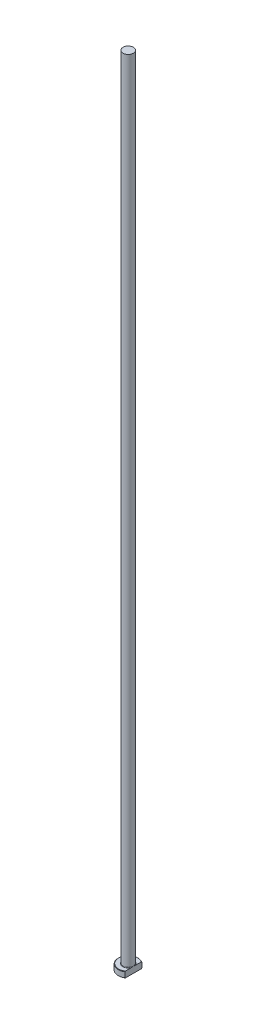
ISO-10303-21;
HEADER;
FILE_DESCRIPTION(('STEP AP214'),'2;1');
FILE_NAME('part.step','',(''),(''),'','','');
FILE_SCHEMA(('AUTOMOTIVE_DESIGN { 1 0 10303 214 1 1 1 1 }'));
ENDSEC;
DATA;
#1=APPLICATION_CONTEXT('core data for automotive mechanical design processes');
#2=APPLICATION_PROTOCOL_DEFINITION('international standard','automotive_design',2000,#1);
#3=PRODUCT_CONTEXT('',#1,'mechanical');
#4=PRODUCT('Part','Part','',(#3));
#5=PRODUCT_RELATED_PRODUCT_CATEGORY('part','',(#4));
#6=PRODUCT_DEFINITION_FORMATION('','',#4);
#7=PRODUCT_DEFINITION_CONTEXT('part definition',#1,'design');
#8=PRODUCT_DEFINITION('design','',#6,#7);
#9=PRODUCT_DEFINITION_SHAPE('','',#8);
#10=(LENGTH_UNIT() NAMED_UNIT(*) SI_UNIT(.MILLI.,.METRE.));
#11=(NAMED_UNIT(*) PLANE_ANGLE_UNIT() SI_UNIT($,.RADIAN.));
#12=(NAMED_UNIT(*) SI_UNIT($,.STERADIAN.) SOLID_ANGLE_UNIT());
#13=UNCERTAINTY_MEASURE_WITH_UNIT(LENGTH_MEASURE(1.E-05),#10,'distance_accuracy_value','');
#14=(GEOMETRIC_REPRESENTATION_CONTEXT(3) GLOBAL_UNCERTAINTY_ASSIGNED_CONTEXT((#13)) GLOBAL_UNIT_ASSIGNED_CONTEXT((#10,
#11,#12)) REPRESENTATION_CONTEXT('',''));
#15=CARTESIAN_POINT('',(0.,0.,0.));
#16=DIRECTION('',(0.,0.,1.));
#17=DIRECTION('',(1.,0.,0.));
#18=AXIS2_PLACEMENT_3D('',#15,#16,#17);
#19=CARTESIAN_POINT('',(0.,0.,0.));
#20=DIRECTION('',(0.,-1.,0.));
#21=DIRECTION('',(0.,0.,-1.));
#22=AXIS2_PLACEMENT_3D('',#19,#20,#21);
#23=PLANE('',#22);
#24=CARTESIAN_POINT('',(0.,0.,0.));
#25=DIRECTION('',(0.,-1.,0.));
#26=DIRECTION('',(0.,0.,-1.));
#27=AXIS2_PLACEMENT_3D('',#24,#25,#26);
#28=CIRCLE('',#27,4.79999999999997);
#29=CARTESIAN_POINT('',(2.59999999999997,0.,4.03484820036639));
#30=VERTEX_POINT('',#29);
#31=CARTESIAN_POINT('',(2.59999999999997,0.,-4.03484820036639));
#32=VERTEX_POINT('',#31);
#33=EDGE_CURVE('E98',#30,#32,#28,.T.);
#34=ORIENTED_EDGE('',*,*,#33,.T.);
#35=DIRECTION('',(0.,0.,1.));
#36=VECTOR('',#35,1.);
#37=CARTESIAN_POINT('',(2.59999999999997,0.,-4.27083130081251));
#38=LINE('',#37,#36);
#39=EDGE_CURVE('E83',#32,#30,#38,.T.);
#40=ORIENTED_EDGE('',*,*,#39,.T.);
#41=EDGE_LOOP('',(#34,#40));
#42=FACE_BOUND('',#41,.T.);
#43=ADVANCED_FACE('F32',(#42),#23,.T.);
#44=CARTESIAN_POINT('',(0.,259.958771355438,0.));
#45=DIRECTION('',(0.,1.,0.));
#46=DIRECTION('',(0.,0.,1.));
#47=AXIS2_PLACEMENT_3D('',#44,#45,#46);
#48=CYLINDRICAL_SURFACE('',#47,4.99999999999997);
#49=CARTESIAN_POINT('',(0.,2.80000000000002,0.));
#50=DIRECTION('',(0.,1.,0.));
#51=DIRECTION('',(0.,0.,1.));
#52=AXIS2_PLACEMENT_3D('',#49,#50,#51);
#53=CIRCLE('',#52,4.99999999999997);
#54=CARTESIAN_POINT('',(2.59999999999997,2.80000000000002,4.27083130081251));
#55=VERTEX_POINT('',#54);
#56=CARTESIAN_POINT('',(2.59999999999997,2.80000000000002,-4.27083130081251));
#57=VERTEX_POINT('',#56);
#58=EDGE_CURVE('E104',#55,#57,#53,.F.);
#59=ORIENTED_EDGE('',*,*,#58,.T.);
#60=DIRECTION('',(0.,-1.,0.));
#61=VECTOR('',#60,1.);
#62=CARTESIAN_POINT('',(2.59999999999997,400.,-4.27083130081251));
#63=LINE('',#62,#61);
#64=CARTESIAN_POINT('',(2.59999999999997,0.199999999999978,-4.27083130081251));
#65=VERTEX_POINT('',#64);
#66=EDGE_CURVE('E183',#57,#65,#63,.T.);
#67=ORIENTED_EDGE('',*,*,#66,.T.);
#68=CARTESIAN_POINT('',(0.,0.199999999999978,0.));
#69=DIRECTION('',(0.,-1.,0.));
#70=DIRECTION('',(0.,0.,-1.));
#71=AXIS2_PLACEMENT_3D('',#68,#69,#70);
#72=CIRCLE('',#71,4.99999999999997);
#73=CARTESIAN_POINT('',(2.59999999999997,0.199999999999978,4.27083130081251));
#74=VERTEX_POINT('',#73);
#75=EDGE_CURVE('E100',#65,#74,#72,.F.);
#76=ORIENTED_EDGE('',*,*,#75,.T.);
#77=DIRECTION('',(0.,-1.,0.));
#78=VECTOR('',#77,1.);
#79=CARTESIAN_POINT('',(2.59999999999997,400.,4.27083130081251));
#80=LINE('',#79,#78);
#81=EDGE_CURVE('E93',#55,#74,#80,.T.);
#82=ORIENTED_EDGE('',*,*,#81,.F.);
#83=EDGE_LOOP('',(#59,#67,#76,#82));
#84=FACE_BOUND('',#83,.T.);
#85=ADVANCED_FACE('F158',(#84),#48,.T.);
#86=CARTESIAN_POINT('',(-4.99999999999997,3.,0.));
#87=DIRECTION('',(0.,1.,0.));
#88=DIRECTION('',(0.,0.,1.));
#89=AXIS2_PLACEMENT_3D('',#86,#87,#88);
#90=PLANE('',#89);
#91=CARTESIAN_POINT('',(0.,3.,0.));
#92=DIRECTION('',(0.,1.,0.));
#93=DIRECTION('',(0.,0.,1.));
#94=AXIS2_PLACEMENT_3D('',#91,#92,#93);
#95=CIRCLE('',#94,4.79999999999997);
#96=CARTESIAN_POINT('',(2.59999999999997,3.,-4.03484820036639));
#97=VERTEX_POINT('',#96);
#98=CARTESIAN_POINT('',(2.59999999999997,3.,4.03484820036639));
#99=VERTEX_POINT('',#98);
#100=EDGE_CURVE('E178',#97,#99,#95,.T.);
#101=ORIENTED_EDGE('',*,*,#100,.T.);
#102=DIRECTION('',(0.,0.,-1.));
#103=VECTOR('',#102,1.);
#104=CARTESIAN_POINT('',(2.59999999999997,3.,0.));
#105=LINE('',#104,#103);
#106=CARTESIAN_POINT('',(2.59999999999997,2.99999999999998,1.03923048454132));
#107=VERTEX_POINT('',#106);
#108=EDGE_CURVE('E57',#99,#107,#105,.T.);
#109=ORIENTED_EDGE('',*,*,#108,.T.);
#110=CARTESIAN_POINT('',(0.,3.,0.));
#111=DIRECTION('',(0.,1.,0.));
#112=DIRECTION('',(0.,0.,1.));
#113=AXIS2_PLACEMENT_3D('',#110,#111,#112);
#114=CIRCLE('',#113,2.79999999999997);
#115=CARTESIAN_POINT('',(2.59999999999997,2.99999999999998,-1.03923048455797));
#116=VERTEX_POINT('',#115);
#117=EDGE_CURVE('E107',#107,#116,#114,.F.);
#118=ORIENTED_EDGE('',*,*,#117,.T.);
#119=EDGE_CURVE('E136',#116,#97,#105,.T.);
#120=ORIENTED_EDGE('',*,*,#119,.T.);
#121=EDGE_LOOP('',(#101,#109,#118,#120));
#122=FACE_BOUND('',#121,.T.);
#123=ADVANCED_FACE('F147',(#122),#90,.T.);
#124=CARTESIAN_POINT('',(0.,3.,0.));
#125=DIRECTION('',(0.,-1.,0.));
#126=DIRECTION('',(0.,0.,-1.));
#127=AXIS2_PLACEMENT_3D('',#124,#125,#126);
#128=CONICAL_SURFACE('',#127,4.79999999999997,0.785398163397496);
#129=ORIENTED_EDGE('',*,*,#58,.F.);
#130=CARTESIAN_POINT('',(2.59999999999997,-1.95047472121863,9.397433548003));
#131=CARTESIAN_POINT('',(2.59999999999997,-1.7601520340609,9.19995130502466));
#132=CARTESIAN_POINT('',(2.59999999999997,-1.57004107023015,9.0022644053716));
#133=CARTESIAN_POINT('',(2.59999999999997,-1.1903545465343,8.60637345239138));
#134=CARTESIAN_POINT('',(2.59999999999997,-1.00077899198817,8.40816939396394));
#135=CARTESIAN_POINT('',(2.59999999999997,-0.622208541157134,8.01106626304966));
#136=CARTESIAN_POINT('',(2.59999999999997,-0.433213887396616,7.81216695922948));
#137=CARTESIAN_POINT('',(2.59999999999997,-0.0560371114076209,7.41360059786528));
#138=CARTESIAN_POINT('',(2.59999999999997,0.132145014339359,7.21393354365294));
#139=CARTESIAN_POINT('',(2.59999999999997,0.504316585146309,6.81701377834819));
#140=CARTESIAN_POINT('',(2.59999999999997,0.688323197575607,6.61977717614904));
#141=CARTESIAN_POINT('',(2.59999999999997,1.05506202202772,6.22412305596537));
#142=CARTESIAN_POINT('',(2.59999999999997,1.23779424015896,6.02570554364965));
#143=CARTESIAN_POINT('',(2.59999999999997,1.60155525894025,5.62737135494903));
#144=CARTESIAN_POINT('',(2.59999999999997,1.7825843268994,5.42745492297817));
#145=CARTESIAN_POINT('',(2.59999999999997,2.14238277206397,5.02560172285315));
#146=CARTESIAN_POINT('',(2.59999999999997,2.32115220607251,4.82366500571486));
#147=CARTESIAN_POINT('',(2.59999999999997,2.62527031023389,4.4746966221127));
#148=CARTESIAN_POINT('',(2.59999999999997,2.75138938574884,4.32833728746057));
#149=CARTESIAN_POINT('',(2.59999999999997,3.00151582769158,4.03379615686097));
#150=CARTESIAN_POINT('',(2.59999999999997,3.12552298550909,3.88561418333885));
#151=CARTESIAN_POINT('',(2.59999999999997,3.37190002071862,3.58545728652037));
#152=CARTESIAN_POINT('',(2.59999999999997,3.49424212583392,3.43345946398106));
#153=CARTESIAN_POINT('',(2.59999999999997,3.73490070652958,3.12636139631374));
#154=CARTESIAN_POINT('',(2.59999999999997,3.85321820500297,2.97126195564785));
#155=CARTESIAN_POINT('',(2.59999999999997,4.08579009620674,2.65464223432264));
#156=CARTESIAN_POINT('',(2.59999999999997,4.19996477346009,2.49306256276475));
#157=CARTESIAN_POINT('',(2.59999999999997,4.36468341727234,2.24613590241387));
#158=CARTESIAN_POINT('',(2.59999999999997,4.41853818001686,2.16300143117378));
#159=CARTESIAN_POINT('',(2.59999999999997,4.52346182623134,1.99499855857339));
#160=CARTESIAN_POINT('',(2.59999999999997,4.574530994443,1.9101303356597));
#161=CARTESIAN_POINT('',(2.59999999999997,4.67263274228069,1.7393256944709));
#162=CARTESIAN_POINT('',(2.59999999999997,4.71970407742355,1.65341183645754));
#163=CARTESIAN_POINT('',(2.59999999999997,4.80952240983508,1.47936505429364));
#164=CARTESIAN_POINT('',(2.59999999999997,4.8522685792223,1.3912317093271));
#165=CARTESIAN_POINT('',(2.59999999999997,4.97211006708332,1.12354274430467));
#166=CARTESIAN_POINT('',(2.59999999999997,5.04118725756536,0.940070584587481));
#167=CARTESIAN_POINT('',(2.59999999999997,5.11752261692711,0.665284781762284));
#168=CARTESIAN_POINT('',(2.59999999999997,5.1380299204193,0.577624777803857));
#169=CARTESIAN_POINT('',(2.59999999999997,5.17073291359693,0.400736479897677));
#170=CARTESIAN_POINT('',(2.59999999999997,5.18292955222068,0.311508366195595));
#171=CARTESIAN_POINT('',(2.59999999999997,5.19813789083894,0.132628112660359));
#172=CARTESIAN_POINT('',(2.59999999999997,5.20118701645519,0.0429792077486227));
#173=CARTESIAN_POINT('',(2.59999999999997,5.19797827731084,-0.13615453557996));
#174=CARTESIAN_POINT('',(2.59999999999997,5.19171987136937,-0.225639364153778));
#175=CARTESIAN_POINT('',(2.59999999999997,5.17043196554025,-0.402893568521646));
#176=CARTESIAN_POINT('',(2.59999999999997,5.15546490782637,-0.490670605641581));
#177=CARTESIAN_POINT('',(2.59999999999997,5.11776551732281,-0.664523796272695));
#178=CARTESIAN_POINT('',(2.59999999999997,5.09503206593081,-0.750599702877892));
#179=CARTESIAN_POINT('',(2.59999999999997,5.04281440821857,-0.921261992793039));
#180=CARTESIAN_POINT('',(2.59999999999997,5.01328729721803,-1.00583506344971));
#181=CARTESIAN_POINT('',(2.59999999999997,4.94875799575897,-1.17281894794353));
#182=CARTESIAN_POINT('',(2.59999999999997,4.91375683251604,-1.25523016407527));
#183=CARTESIAN_POINT('',(2.59999999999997,4.80599778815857,-1.49096020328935));
#184=CARTESIAN_POINT('',(2.59999999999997,4.72750956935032,-1.64165062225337));
#185=CARTESIAN_POINT('',(2.59999999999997,4.55999715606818,-1.93711610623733));
#186=CARTESIAN_POINT('',(2.59999999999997,4.47096030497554,-2.08188377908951));
#187=CARTESIAN_POINT('',(2.59999999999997,4.28541544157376,-2.36729512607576));
#188=CARTESIAN_POINT('',(2.59999999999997,4.18888021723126,-2.50792095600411));
#189=CARTESIAN_POINT('',(2.59999999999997,3.99085344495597,-2.78550445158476));
#190=CARTESIAN_POINT('',(2.59999999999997,3.88936425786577,-2.92246381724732));
#191=CARTESIAN_POINT('',(2.59999999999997,3.68147097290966,-3.19533708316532));
#192=CARTESIAN_POINT('',(2.59999999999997,3.57502092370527,-3.3312158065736));
#193=CARTESIAN_POINT('',(2.59999999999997,3.35937457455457,-3.60078977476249));
#194=CARTESIAN_POINT('',(2.59999999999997,3.25017800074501,-3.7344847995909));
#195=CARTESIAN_POINT('',(2.59999999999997,3.02996614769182,-3.99983567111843));
#196=CARTESIAN_POINT('',(2.59999999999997,2.9189557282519,-4.1314955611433));
#197=CARTESIAN_POINT('',(2.59999999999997,2.69532568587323,-4.39344289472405));
#198=CARTESIAN_POINT('',(2.59999999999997,2.58270603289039,-4.52373031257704));
#199=CARTESIAN_POINT('',(2.59999999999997,2.28823888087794,-4.86104966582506));
#200=CARTESIAN_POINT('',(2.59999999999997,2.10540318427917,-5.06721827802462));
#201=CARTESIAN_POINT('',(2.59999999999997,1.73743041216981,-5.47749422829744));
#202=CARTESIAN_POINT('',(2.59999999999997,1.55229327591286,-5.68160151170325));
#203=CARTESIAN_POINT('',(2.59999999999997,1.18015264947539,-6.08844300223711));
#204=CARTESIAN_POINT('',(2.59999999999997,0.993147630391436,-6.29117580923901));
#205=CARTESIAN_POINT('',(2.59999999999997,0.617846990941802,-6.69544313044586));
#206=CARTESIAN_POINT('',(2.59999999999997,0.429551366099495,-6.89697764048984));
#207=CARTESIAN_POINT('',(2.59999999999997,0.0594707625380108,-7.29110398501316));
#208=CARTESIAN_POINT('',(2.59999999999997,-0.12227513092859,-7.48373254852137));
#209=CARTESIAN_POINT('',(2.59999999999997,-0.486506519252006,-7.86829020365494));
#210=CARTESIAN_POINT('',(2.59999999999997,-0.668992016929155,-8.06021929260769));
#211=CARTESIAN_POINT('',(2.59999999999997,-1.03436396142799,-8.44329936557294));
#212=CARTESIAN_POINT('',(2.59999999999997,-1.21724976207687,-8.63445096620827));
#213=CARTESIAN_POINT('',(2.59999999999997,-1.58351605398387,-9.01627657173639));
#214=CARTESIAN_POINT('',(2.59999999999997,-1.76689654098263,-9.20695058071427));
#215=CARTESIAN_POINT('',(2.59999999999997,-1.95047472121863,-9.397433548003));
#216=B_SPLINE_CURVE_WITH_KNOTS('',3,(#130,#131,#132,#133,#134,#135,#136,#137,#138,#139,#140,
#141,#142,#143,#144,#145,#146,#147,#148,#149,#150,#151,#152,#153,#154,#155,#156,#157,#158,#159,
#160,#161,#162,#163,#164,#165,#166,#167,#168,#169,#170,#171,#172,#173,#174,#175,#176,#177,#178,
#179,#180,#181,#182,#183,#184,#185,#186,#187,#188,#189,#190,#191,#192,#193,#194,#195,#196,#197,
#198,#199,#200,#201,#202,#203,#204,#205,#206,#207,#208,#209,#210,#211,#212,#213,#214,#215),
.UNSPECIFIED.,.F.,.F.,(4,2,2,2,2,2,2,2,2,2,2,2,2,2,2,2,2,2,2,2,2,2,2,2,2,2,2,2,2,2,2,2,2,2,2,2,
2,2,2,2,2,2,4),(0.,0.822799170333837,1.64560648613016,2.46872021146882,3.29183036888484,
4.10105194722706,4.91026964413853,5.71935814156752,6.5284262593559,7.10801764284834,
7.68766594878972,8.27296873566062,8.85812163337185,9.45143823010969,9.74855643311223,
10.0456442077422,10.3394095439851,10.6332310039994,11.2186835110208,11.4884410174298,
11.7581677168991,12.0267893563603,12.2954266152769,12.5621610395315,12.8289338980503,
13.0974401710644,13.3658961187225,13.8748906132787,14.3845021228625,14.896058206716,
15.4073728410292,15.9251595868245,16.4429981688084,16.9596236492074,17.4762587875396,
18.3029176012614,19.1295982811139,19.9570225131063,20.7844496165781,21.5789508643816,
22.3734551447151,23.1671010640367,23.9607401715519),.UNSPECIFIED.);
#217=EDGE_CURVE('E135',#55,#99,#216,.T.);
#218=ORIENTED_EDGE('',*,*,#217,.T.);
#219=ORIENTED_EDGE('',*,*,#100,.F.);
#220=EDGE_CURVE('E127',#97,#57,#216,.T.);
#221=ORIENTED_EDGE('',*,*,#220,.T.);
#222=EDGE_LOOP('',(#129,#218,#219,#221));
#223=FACE_BOUND('',#222,.T.);
#224=ADVANCED_FACE('F143',(#223),#128,.T.);
#225=CARTESIAN_POINT('',(0.,0.199999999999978,0.));
#226=DIRECTION('',(0.,1.,0.));
#227=DIRECTION('',(0.,0.,1.));
#228=AXIS2_PLACEMENT_3D('',#225,#226,#227);
#229=CONICAL_SURFACE('',#228,4.99999999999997,0.785398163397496);
#230=ORIENTED_EDGE('',*,*,#75,.F.);
#231=CARTESIAN_POINT('',(2.59999999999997,4.95047472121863,-9.397433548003));
#232=CARTESIAN_POINT('',(2.59999999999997,4.7601520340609,-9.19995130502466));
#233=CARTESIAN_POINT('',(2.59999999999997,4.57004107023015,-9.0022644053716));
#234=CARTESIAN_POINT('',(2.59999999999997,4.1903545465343,-8.60637345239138));
#235=CARTESIAN_POINT('',(2.59999999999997,4.00077899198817,-8.40816939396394));
#236=CARTESIAN_POINT('',(2.59999999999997,3.62220854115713,-8.01106626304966));
#237=CARTESIAN_POINT('',(2.59999999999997,3.43321388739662,-7.81216695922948));
#238=CARTESIAN_POINT('',(2.59999999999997,3.05603711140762,-7.41360059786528));
#239=CARTESIAN_POINT('',(2.59999999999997,2.86785498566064,-7.21393354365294));
#240=CARTESIAN_POINT('',(2.59999999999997,2.49568341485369,-6.81701377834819));
#241=CARTESIAN_POINT('',(2.59999999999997,2.3116768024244,-6.61977717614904));
#242=CARTESIAN_POINT('',(2.59999999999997,1.94493797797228,-6.22412305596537));
#243=CARTESIAN_POINT('',(2.59999999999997,1.76220575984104,-6.02570554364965));
#244=CARTESIAN_POINT('',(2.59999999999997,1.39844474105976,-5.62737135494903));
#245=CARTESIAN_POINT('',(2.59999999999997,1.2174156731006,-5.42745492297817));
#246=CARTESIAN_POINT('',(2.59999999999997,0.857617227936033,-5.02560172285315));
#247=CARTESIAN_POINT('',(2.59999999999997,0.67884779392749,-4.82366500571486));
#248=CARTESIAN_POINT('',(2.59999999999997,0.374729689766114,-4.4746966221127));
#249=CARTESIAN_POINT('',(2.59999999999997,0.248610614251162,-4.32833728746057));
#250=CARTESIAN_POINT('',(2.59999999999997,-0.0015158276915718,-4.03379615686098));
#251=CARTESIAN_POINT('',(2.59999999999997,-0.125522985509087,-3.88561418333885));
#252=CARTESIAN_POINT('',(2.59999999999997,-0.371900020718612,-3.58545728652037));
#253=CARTESIAN_POINT('',(2.59999999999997,-0.494242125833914,-3.43345946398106));
#254=CARTESIAN_POINT('',(2.59999999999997,-0.734900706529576,-3.12636139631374));
#255=CARTESIAN_POINT('',(2.59999999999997,-0.853218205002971,-2.97126195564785));
#256=CARTESIAN_POINT('',(2.59999999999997,-1.08579009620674,-2.65464223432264));
#257=CARTESIAN_POINT('',(2.59999999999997,-1.19996477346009,-2.49306256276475));
#258=CARTESIAN_POINT('',(2.59999999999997,-1.36468341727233,-2.24613590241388));
#259=CARTESIAN_POINT('',(2.59999999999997,-1.41853818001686,-2.16300143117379));
#260=CARTESIAN_POINT('',(2.59999999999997,-1.52346182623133,-1.99499855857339));
#261=CARTESIAN_POINT('',(2.59999999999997,-1.574530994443,-1.9101303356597));
#262=CARTESIAN_POINT('',(2.59999999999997,-1.67263274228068,-1.7393256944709));
#263=CARTESIAN_POINT('',(2.59999999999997,-1.71970407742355,-1.65341183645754));
#264=CARTESIAN_POINT('',(2.59999999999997,-1.80952240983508,-1.47936505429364));
#265=CARTESIAN_POINT('',(2.59999999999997,-1.8522685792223,-1.3912317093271));
#266=CARTESIAN_POINT('',(2.59999999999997,-1.97211006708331,-1.12354274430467));
#267=CARTESIAN_POINT('',(2.59999999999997,-2.04118725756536,-0.940070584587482));
#268=CARTESIAN_POINT('',(2.59999999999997,-2.11752261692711,-0.665284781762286));
#269=CARTESIAN_POINT('',(2.59999999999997,-2.1380299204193,-0.577624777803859));
#270=CARTESIAN_POINT('',(2.59999999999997,-2.17073291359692,-0.400736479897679));
#271=CARTESIAN_POINT('',(2.59999999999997,-2.18292955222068,-0.311508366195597));
#272=CARTESIAN_POINT('',(2.59999999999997,-2.19813789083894,-0.132628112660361));
#273=CARTESIAN_POINT('',(2.59999999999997,-2.20118701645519,-0.0429792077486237));
#274=CARTESIAN_POINT('',(2.59999999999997,-2.19797827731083,0.136154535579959));
#275=CARTESIAN_POINT('',(2.59999999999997,-2.19171987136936,0.225639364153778));
#276=CARTESIAN_POINT('',(2.59999999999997,-2.17043196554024,0.402893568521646));
#277=CARTESIAN_POINT('',(2.59999999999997,-2.15546490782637,0.490670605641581));
#278=CARTESIAN_POINT('',(2.59999999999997,-2.11776551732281,0.664523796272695));
#279=CARTESIAN_POINT('',(2.59999999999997,-2.09503206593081,0.750599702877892));
#280=CARTESIAN_POINT('',(2.59999999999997,-2.04281440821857,0.921261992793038));
#281=CARTESIAN_POINT('',(2.59999999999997,-2.01328729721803,1.00583506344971));
#282=CARTESIAN_POINT('',(2.59999999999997,-1.94875799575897,1.17281894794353));
#283=CARTESIAN_POINT('',(2.59999999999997,-1.91375683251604,1.25523016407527));
#284=CARTESIAN_POINT('',(2.59999999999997,-1.80599778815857,1.49096020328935));
#285=CARTESIAN_POINT('',(2.59999999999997,-1.72750956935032,1.64165062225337));
#286=CARTESIAN_POINT('',(2.59999999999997,-1.55999715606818,1.93711610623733));
#287=CARTESIAN_POINT('',(2.59999999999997,-1.47096030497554,2.08188377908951));
#288=CARTESIAN_POINT('',(2.59999999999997,-1.28541544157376,2.36729512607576));
#289=CARTESIAN_POINT('',(2.59999999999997,-1.18888021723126,2.50792095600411));
#290=CARTESIAN_POINT('',(2.59999999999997,-0.990853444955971,2.78550445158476));
#291=CARTESIAN_POINT('',(2.59999999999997,-0.889364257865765,2.92246381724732));
#292=CARTESIAN_POINT('',(2.59999999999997,-0.681470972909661,3.19533708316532));
#293=CARTESIAN_POINT('',(2.59999999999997,-0.575020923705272,3.3312158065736));
#294=CARTESIAN_POINT('',(2.59999999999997,-0.359374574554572,3.60078977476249));
#295=CARTESIAN_POINT('',(2.59999999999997,-0.250178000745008,3.7344847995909));
#296=CARTESIAN_POINT('',(2.59999999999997,-0.0299661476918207,3.99983567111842));
#297=CARTESIAN_POINT('',(2.59999999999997,0.0810442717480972,4.13149556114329));
#298=CARTESIAN_POINT('',(2.59999999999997,0.304674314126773,4.39344289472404));
#299=CARTESIAN_POINT('',(2.59999999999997,0.41729396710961,4.52373031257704));
#300=CARTESIAN_POINT('',(2.59999999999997,0.711761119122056,4.86104966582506));
#301=CARTESIAN_POINT('',(2.59999999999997,0.894596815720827,5.06721827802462));
#302=CARTESIAN_POINT('',(2.59999999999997,1.2625695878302,5.47749422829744));
#303=CARTESIAN_POINT('',(2.59999999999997,1.44770672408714,5.68160151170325));
#304=CARTESIAN_POINT('',(2.59999999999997,1.81984735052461,6.08844300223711));
#305=CARTESIAN_POINT('',(2.59999999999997,2.00685236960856,6.29117580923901));
#306=CARTESIAN_POINT('',(2.59999999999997,2.3821530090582,6.69544313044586));
#307=CARTESIAN_POINT('',(2.59999999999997,2.57044863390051,6.89697764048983));
#308=CARTESIAN_POINT('',(2.59999999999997,2.94052923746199,7.29110398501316));
#309=CARTESIAN_POINT('',(2.59999999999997,3.12227513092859,7.48373254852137));
#310=CARTESIAN_POINT('',(2.59999999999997,3.48650651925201,7.86829020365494));
#311=CARTESIAN_POINT('',(2.59999999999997,3.66899201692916,8.06021929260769));
#312=CARTESIAN_POINT('',(2.59999999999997,4.03436396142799,8.44329936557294));
#313=CARTESIAN_POINT('',(2.59999999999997,4.21724976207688,8.63445096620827));
#314=CARTESIAN_POINT('',(2.59999999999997,4.58351605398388,9.01627657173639));
#315=CARTESIAN_POINT('',(2.59999999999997,4.76689654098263,9.20695058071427));
#316=CARTESIAN_POINT('',(2.59999999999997,4.95047472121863,9.397433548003));
#317=B_SPLINE_CURVE_WITH_KNOTS('',3,(#231,#232,#233,#234,#235,#236,#237,#238,#239,#240,#241,
#242,#243,#244,#245,#246,#247,#248,#249,#250,#251,#252,#253,#254,#255,#256,#257,#258,#259,#260,
#261,#262,#263,#264,#265,#266,#267,#268,#269,#270,#271,#272,#273,#274,#275,#276,#277,#278,#279,
#280,#281,#282,#283,#284,#285,#286,#287,#288,#289,#290,#291,#292,#293,#294,#295,#296,#297,#298,
#299,#300,#301,#302,#303,#304,#305,#306,#307,#308,#309,#310,#311,#312,#313,#314,#315,#316),
.UNSPECIFIED.,.F.,.F.,(4,2,2,2,2,2,2,2,2,2,2,2,2,2,2,2,2,2,2,2,2,2,2,2,2,2,2,2,2,2,2,2,2,2,2,2,
2,2,2,2,2,2,4),(0.,0.822799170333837,1.64560648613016,2.46872021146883,3.29183036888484,
4.10105194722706,4.91026964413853,5.71935814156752,6.5284262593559,7.10801764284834,
7.68766594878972,8.27296873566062,8.85812163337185,9.45143823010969,9.74855643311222,
10.0456442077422,10.3394095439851,10.6332310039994,11.2186835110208,11.4884410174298,
11.7581677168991,12.0267893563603,12.2954266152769,12.5621610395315,12.8289338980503,
13.0974401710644,13.3658961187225,13.8748906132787,14.3845021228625,14.896058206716,
15.4073728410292,15.9251595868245,16.4429981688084,16.9596236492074,17.4762587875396,
18.3029176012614,19.1295982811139,19.9570225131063,20.7844496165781,21.5789508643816,
22.3734551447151,23.1671010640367,23.9607401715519),.UNSPECIFIED.);
#318=EDGE_CURVE('E86',#65,#32,#317,.T.);
#319=ORIENTED_EDGE('',*,*,#318,.T.);
#320=ORIENTED_EDGE('',*,*,#33,.F.);
#321=EDGE_CURVE('E89',#30,#74,#317,.T.);
#322=ORIENTED_EDGE('',*,*,#321,.T.);
#323=EDGE_LOOP('',(#230,#319,#320,#322));
#324=FACE_BOUND('',#323,.T.);
#325=ADVANCED_FACE('F97',(#324),#229,.T.);
#326=CARTESIAN_POINT('',(0.,3.19999999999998,0.));
#327=DIRECTION('',(0.,1.,0.));
#328=DIRECTION('',(0.,0.,1.));
#329=AXIS2_PLACEMENT_3D('',#326,#327,#328);
#330=TOROIDAL_SURFACE('',#329,2.79999999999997,0.2);
#331=CARTESIAN_POINT('',(2.59999999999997,3.19999999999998,0.));
#332=CARTESIAN_POINT('',(2.59999999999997,3.20000050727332,1.23579409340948E-10));
#333=CARTESIAN_POINT('',(2.59999999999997,3.20000101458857,-1.74789552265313E-07));
#334=CARTESIAN_POINT('',(2.59999999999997,3.20000196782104,-6.73287793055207E-07));
#335=CARTESIAN_POINT('',(2.59999999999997,3.20000240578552,-1.00747163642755E-06));
#336=CARTESIAN_POINT('',(2.59999999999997,3.20000330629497,-1.80604944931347E-06));
#337=CARTESIAN_POINT('',(2.59999999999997,3.20000375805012,-2.28310921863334E-06));
#338=CARTESIAN_POINT('',(2.59999999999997,3.20000457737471,-3.28018171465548E-06));
#339=CARTESIAN_POINT('',(2.59999999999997,3.20000494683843,-3.79874305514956E-06));
#340=CARTESIAN_POINT('',(2.59999999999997,3.20000629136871,-5.77594334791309E-06));
#341=CARTESIAN_POINT('',(2.59999999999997,3.20000719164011,-7.28765589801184E-06));
#342=CARTESIAN_POINT('',(2.59999999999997,3.20000869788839,-1.03067582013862E-05));
#343=CARTESIAN_POINT('',(2.59999999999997,3.20000932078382,-1.18060929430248E-05));
#344=CARTESIAN_POINT('',(2.59999999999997,3.20001188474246,-1.80612988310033E-05));
#345=CARTESIAN_POINT('',(2.59999999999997,3.20001376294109,-2.28467812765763E-05));
#346=CARTESIAN_POINT('',(2.59999999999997,3.20001657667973,-3.19530305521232E-05));
#347=CARTESIAN_POINT('',(2.59999999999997,3.20001760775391,-3.62442681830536E-05));
#348=CARTESIAN_POINT('',(2.59999999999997,3.20002504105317,-6.7868346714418E-05));
#349=CARTESIAN_POINT('',(2.59999999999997,3.20003059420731,-9.53536176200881E-05));
#350=CARTESIAN_POINT('',(2.59999999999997,3.20005490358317,-0.000203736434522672));
#351=CARTESIAN_POINT('',(2.59999999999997,3.20007818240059,-0.000283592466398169));
#352=CARTESIAN_POINT('',(2.59999999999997,3.2001686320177,-0.000599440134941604));
#353=CARTESIAN_POINT('',(2.59999999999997,3.2002328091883,-0.000836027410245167));
#354=CARTESIAN_POINT('',(2.59999999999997,3.20048945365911,-0.00177477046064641));
#355=CARTESIAN_POINT('',(2.59999999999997,3.20068565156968,-0.00247616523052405));
#356=CARTESIAN_POINT('',(2.59999999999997,3.20149940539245,-0.0053934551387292));
#357=CARTESIAN_POINT('',(2.59999999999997,3.20211229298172,-0.007610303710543));
#358=CARTESIAN_POINT('',(2.59999999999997,3.2076646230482,-0.0276831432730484));
#359=CARTESIAN_POINT('',(2.59999999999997,3.21262302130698,-0.0455354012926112));
#360=CARTESIAN_POINT('',(2.59999999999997,3.22230897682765,-0.0805439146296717));
#361=CARTESIAN_POINT('',(2.59999999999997,3.22703791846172,-0.0976998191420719));
#362=CARTESIAN_POINT('',(2.59999999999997,3.23705035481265,-0.134181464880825));
#363=CARTESIAN_POINT('',(2.59999999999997,3.2423287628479,-0.153508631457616));
#364=CARTESIAN_POINT('',(2.59999999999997,3.25286316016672,-0.192393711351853));
#365=CARTESIAN_POINT('',(2.59999999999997,3.25811828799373,-0.211951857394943));
#366=CARTESIAN_POINT('',(2.59999999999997,3.27070509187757,-0.259316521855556));
#367=CARTESIAN_POINT('',(2.59999999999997,3.27798202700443,-0.287137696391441));
#368=CARTESIAN_POINT('',(2.59999999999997,3.29204094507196,-0.342105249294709));
#369=CARTESIAN_POINT('',(2.59999999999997,3.29883098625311,-0.36924957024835));
#370=CARTESIAN_POINT('',(2.59999999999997,3.32069835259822,-0.459246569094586));
#371=CARTESIAN_POINT('',(2.59999999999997,3.33498012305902,-0.522296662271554));
#372=CARTESIAN_POINT('',(2.59999999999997,3.36056532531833,-0.649787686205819));
#373=CARTESIAN_POINT('',(2.59999999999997,3.37183254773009,-0.714236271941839));
#374=CARTESIAN_POINT('',(2.59999999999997,3.38542084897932,-0.81395858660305));
#375=CARTESIAN_POINT('',(2.59999999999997,3.38947199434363,-0.84899397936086));
#376=CARTESIAN_POINT('',(2.59999999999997,3.39578733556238,-0.91922149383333));
#377=CARTESIAN_POINT('',(2.59999999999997,3.39805216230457,-0.954413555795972));
#378=CARTESIAN_POINT('',(2.59999999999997,3.40031330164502,-1.02465521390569));
#379=CARTESIAN_POINT('',(2.59999999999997,3.40032384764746,-1.05970430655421));
#380=CARTESIAN_POINT('',(2.59999999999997,3.39745377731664,-1.1296713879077));
#381=CARTESIAN_POINT('',(2.59999999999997,3.39457726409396,-1.16458949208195));
#382=CARTESIAN_POINT('',(2.59999999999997,3.38762659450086,-1.21434358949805));
#383=CARTESIAN_POINT('',(2.59999999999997,3.3851418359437,-1.22940327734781));
#384=CARTESIAN_POINT('',(2.59999999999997,3.37928992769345,-1.25936829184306));
#385=CARTESIAN_POINT('',(2.59999999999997,3.37592199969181,-1.27427347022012));
#386=CARTESIAN_POINT('',(2.59999999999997,3.36819593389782,-1.30360801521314));
#387=CARTESIAN_POINT('',(2.59999999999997,3.36385215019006,-1.31804111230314));
#388=CARTESIAN_POINT('',(2.59999999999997,3.35394180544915,-1.34647366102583));
#389=CARTESIAN_POINT('',(2.59999999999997,3.34837682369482,-1.36047364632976));
#390=CARTESIAN_POINT('',(2.59999999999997,3.3378467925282,-1.3832098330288));
#391=CARTESIAN_POINT('',(2.59999999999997,3.33330355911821,-1.39214053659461));
#392=CARTESIAN_POINT('',(2.59999999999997,3.32341812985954,-1.40958482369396));
#393=CARTESIAN_POINT('',(2.59999999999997,3.31807401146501,-1.41809733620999));
#394=CARTESIAN_POINT('',(2.59999999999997,3.3064185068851,-1.43453575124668));
#395=CARTESIAN_POINT('',(2.59999999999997,3.30010038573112,-1.44245695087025));
#396=CARTESIAN_POINT('',(2.59999999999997,3.28637957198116,-1.45729976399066));
#397=CARTESIAN_POINT('',(2.59999999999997,3.27897945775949,-1.46422367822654));
#398=CARTESIAN_POINT('',(2.59999999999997,3.26567821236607,-1.47448129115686));
#399=CARTESIAN_POINT('',(2.59999999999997,3.26010727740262,-1.47824010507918));
#400=CARTESIAN_POINT('',(2.59999999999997,3.24845655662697,-1.48487520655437));
#401=CARTESIAN_POINT('',(2.59999999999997,3.24237710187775,-1.4877520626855));
#402=CARTESIAN_POINT('',(2.59999999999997,3.22972757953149,-1.49241784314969));
#403=CARTESIAN_POINT('',(2.59999999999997,3.22315282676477,-1.49419437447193));
#404=CARTESIAN_POINT('',(2.59999999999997,3.20978231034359,-1.49640812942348));
#405=CARTESIAN_POINT('',(2.59999999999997,3.20298682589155,-1.49684698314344));
#406=CARTESIAN_POINT('',(2.59999999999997,3.19037691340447,-1.49637060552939));
#407=CARTESIAN_POINT('',(2.59999999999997,3.18455503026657,-1.49563180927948));
#408=CARTESIAN_POINT('',(2.59999999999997,3.17311801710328,-1.49319000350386));
#409=CARTESIAN_POINT('',(2.59999999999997,3.1675030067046,-1.49148644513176));
#410=CARTESIAN_POINT('',(2.59999999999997,3.15514195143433,-1.48668054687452));
#411=CARTESIAN_POINT('',(2.59999999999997,3.14849468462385,-1.48332605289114));
#412=CARTESIAN_POINT('',(2.59999999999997,3.13582833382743,-1.47559145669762));
#413=CARTESIAN_POINT('',(2.59999999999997,3.12981053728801,-1.47120930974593));
#414=CARTESIAN_POINT('',(2.59999999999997,3.11535552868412,-1.45914343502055));
#415=CARTESIAN_POINT('',(2.59999999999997,3.10734855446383,-1.45094839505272));
#416=CARTESIAN_POINT('',(2.59999999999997,3.09265977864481,-1.43346680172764));
#417=CARTESIAN_POINT('',(2.59999999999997,3.08598026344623,-1.4241784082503));
#418=CARTESIAN_POINT('',(2.59999999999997,3.06857102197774,-1.39681642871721));
#419=CARTESIAN_POINT('',(2.59999999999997,3.05915220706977,-1.37791719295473));
#420=CARTESIAN_POINT('',(2.59999999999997,3.04297062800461,-1.3389290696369));
#421=CARTESIAN_POINT('',(2.59999999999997,3.03622846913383,-1.31883227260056));
#422=CARTESIAN_POINT('',(2.59999999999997,3.02432998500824,-1.27632728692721));
#423=CARTESIAN_POINT('',(2.59999999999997,3.01935848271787,-1.25386836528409));
#424=CARTESIAN_POINT('',(2.59999999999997,3.01130018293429,-1.20858750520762));
#425=CARTESIAN_POINT('',(2.59999999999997,3.00821705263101,-1.18576494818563));
#426=CARTESIAN_POINT('',(2.59999999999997,3.00363796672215,-1.1405967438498));
#427=CARTESIAN_POINT('',(2.59999999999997,3.00210096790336,-1.11825509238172));
#428=CARTESIAN_POINT('',(2.59999999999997,3.00022491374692,-1.07361049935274));
#429=CARTESIAN_POINT('',(2.59999999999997,2.99988136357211,-1.05130772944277));
#430=CARTESIAN_POINT('',(2.59999999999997,3.00029323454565,-0.991792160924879));
#431=CARTESIAN_POINT('',(2.59999999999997,3.00193756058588,-0.954585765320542));
#432=CARTESIAN_POINT('',(2.59999999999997,3.00736147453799,-0.880345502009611));
#433=CARTESIAN_POINT('',(2.59999999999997,3.01114096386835,-0.843311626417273));
#434=CARTESIAN_POINT('',(2.59999999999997,3.02049059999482,-0.768589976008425));
#435=CARTESIAN_POINT('',(2.59999999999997,3.02610078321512,-0.730907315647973));
#436=CARTESIAN_POINT('',(2.59999999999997,3.0387231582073,-0.655686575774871));
#437=CARTESIAN_POINT('',(2.59999999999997,3.0457387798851,-0.618149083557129));
#438=CARTESIAN_POINT('',(2.59999999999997,3.06358120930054,-0.52980872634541));
#439=CARTESIAN_POINT('',(2.59999999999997,3.07487037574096,-0.479100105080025));
#440=CARTESIAN_POINT('',(2.59999999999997,3.09870164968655,-0.378576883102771));
#441=CARTESIAN_POINT('',(2.59999999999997,3.1112285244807,-0.328758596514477));
#442=CARTESIAN_POINT('',(2.59999999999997,3.13564556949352,-0.234990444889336));
#443=CARTESIAN_POINT('',(2.59999999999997,3.14744634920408,-0.191016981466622));
#444=CARTESIAN_POINT('',(2.59999999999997,3.17192746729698,-0.101304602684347));
#445=CARTESIAN_POINT('',(2.59999999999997,3.18462387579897,-0.0555700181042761));
#446=CARTESIAN_POINT('',(2.59999999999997,3.19788889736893,-0.00760560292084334));
#447=CARTESIAN_POINT('',(2.59999999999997,3.19850316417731,-0.00538409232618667));
#448=CARTESIAN_POINT('',(2.59999999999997,3.19931724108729,-0.00246573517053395));
#449=CARTESIAN_POINT('',(2.59999999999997,3.19951242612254,-0.00176794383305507));
#450=CARTESIAN_POINT('',(2.59999999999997,3.19976783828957,-0.000833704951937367));
#451=CARTESIAN_POINT('',(2.59999999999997,3.19983177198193,-0.000598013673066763));
#452=CARTESIAN_POINT('',(2.59999999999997,3.19992192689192,-0.000283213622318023));
#453=CARTESIAN_POINT('',(2.59999999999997,3.19994516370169,-0.00020351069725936));
#454=CARTESIAN_POINT('',(2.59999999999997,3.19996943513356,-9.53048357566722E-05));
#455=CARTESIAN_POINT('',(2.59999999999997,3.19997498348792,-6.78414250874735E-05));
#456=CARTESIAN_POINT('',(2.59999999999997,3.1999824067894,-3.62395621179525E-05));
#457=CARTESIAN_POINT('',(2.59999999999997,3.19998343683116,-3.19495761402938E-05));
#458=CARTESIAN_POINT('',(2.59999999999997,3.19998624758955,-2.2845859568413E-05));
#459=CARTESIAN_POINT('',(2.59999999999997,3.19998812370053,-1.80615919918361E-05));
#460=CARTESIAN_POINT('',(2.59999999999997,3.19999068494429,-1.18076342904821E-05));
#461=CARTESIAN_POINT('',(2.59999999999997,3.19999130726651,-1.03083932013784E-05));
#462=CARTESIAN_POINT('',(2.59999999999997,3.19999281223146,-7.28938063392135E-06));
#463=CARTESIAN_POINT('',(2.59999999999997,3.19999371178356,-5.77765312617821E-06));
#464=CARTESIAN_POINT('',(2.59999999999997,3.19999505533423,-3.80031827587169E-06));
#465=CARTESIAN_POINT('',(2.59999999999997,3.19999542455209,-3.28169096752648E-06));
#466=CARTESIAN_POINT('',(2.59999999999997,3.19999624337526,-2.28444217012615E-06));
#467=CARTESIAN_POINT('',(2.59999999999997,3.19999669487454,-1.80727069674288E-06));
#468=CARTESIAN_POINT('',(2.59999999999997,3.19999759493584,-1.00842880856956E-06));
#469=CARTESIAN_POINT('',(2.59999999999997,3.19999803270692,-6.74101888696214E-07));
#470=CARTESIAN_POINT('',(2.59999999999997,3.19999898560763,-1.75245051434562E-07));
#471=CARTESIAN_POINT('',(2.59999999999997,3.19999949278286,-1.23565714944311E-10));
#472=CARTESIAN_POINT('',(2.59999999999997,3.19999999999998,0.));
#473=B_SPLINE_CURVE_WITH_KNOTS('',3,(#331,#332,#333,#334,#335,#336,#337,#338,#339,#340,#341,
#342,#343,#344,#345,#346,#347,#348,#349,#350,#351,#352,#353,#354,#355,#356,#357,#358,#359,#360,
#361,#362,#363,#364,#365,#366,#367,#368,#369,#370,#371,#372,#373,#374,#375,#376,#377,#378,#379,
#380,#381,#382,#383,#384,#385,#386,#387,#388,#389,#390,#391,#392,#393,#394,#395,#396,#397,#398,
#399,#400,#401,#402,#403,#404,#405,#406,#407,#408,#409,#410,#411,#412,#413,#414,#415,#416,#417,
#418,#419,#420,#421,#422,#423,#424,#425,#426,#427,#428,#429,#430,#431,#432,#433,#434,#435,#436,
#437,#438,#439,#440,#441,#442,#443,#444,#445,#446,#447,#448,#449,#450,#451,#452,#453,#454,#455,
#456,#457,#458,#459,#460,#461,#462,#463,#464,#465,#466,#467,#468,#469,#470,#471,#472),
.UNSPECIFIED.,.T.,.F.,(4,2,2,2,2,2,2,2,2,2,2,2,2,2,2,2,2,2,2,2,2,2,2,2,2,2,2,2,2,2,2,2,2,2,2,2,
2,2,2,2,2,2,2,2,2,2,2,2,2,2,2,2,2,2,2,2,2,2,2,2,2,2,2,2,2,2,2,2,2,2,4),(0.,1.53042757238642E-06,
3.18106748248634E-06,5.14121990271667E-06,7.05005828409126E-06,1.23079983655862E-05,
1.7174539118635E-05,3.25667081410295E-05,4.57900795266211E-05,0.00012992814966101,
0.00037919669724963,0.00111488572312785,0.00329950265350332,0.0101999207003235,
0.0657821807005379,0.119169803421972,0.179274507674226,0.24002995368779,0.326299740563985,
0.410240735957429,0.6041400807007,0.800273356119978,0.906045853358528,1.01178097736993,
1.1168484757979,1.22176686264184,1.26753679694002,1.31334720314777,1.35852340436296,
1.40364152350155,1.43367014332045,1.46377203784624,1.49409227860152,1.52434140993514,
1.54444068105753,1.56452696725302,1.58483555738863,1.6051193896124,1.62263810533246,
1.64016679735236,1.66238011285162,1.6846380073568,1.71881594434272,1.75305224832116,
1.81604715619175,1.87951801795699,1.94841441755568,2.01744419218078,2.08458891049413,
2.15148046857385,2.26311962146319,2.37475362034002,2.48901400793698,2.60355671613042,
2.75937570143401,2.91347192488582,3.0500585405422,3.19244561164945,3.19936059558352,
3.20153398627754,3.20226688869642,3.20251568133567,3.2025997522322,3.20261297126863,
3.20262835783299,3.20263322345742,3.20263848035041,3.20264038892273,3.2026423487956,
3.20264399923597,3.20264552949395),.UNSPECIFIED.);
#474=CARTESIAN_POINT('',(2.59999999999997,3.19999999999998,0.));
#475=VERTEX_POINT('',#474);
#476=EDGE_CURVE('E11',#116,#475,#473,.T.);
#477=ORIENTED_EDGE('',*,*,#476,.F.);
#478=ORIENTED_EDGE('',*,*,#117,.F.);
#479=CARTESIAN_POINT('',(2.59999999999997,3.19999999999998,0.));
#480=CARTESIAN_POINT('',(2.59999999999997,3.19999949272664,-1.23579435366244E-10));
#481=CARTESIAN_POINT('',(2.59999999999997,3.19999898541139,1.74789552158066E-07));
#482=CARTESIAN_POINT('',(2.59999999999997,3.19999803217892,6.73287792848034E-07));
#483=CARTESIAN_POINT('',(2.59999999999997,3.19999759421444,1.00747163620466E-06));
#484=CARTESIAN_POINT('',(2.59999999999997,3.19999669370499,1.80604944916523E-06));
#485=CARTESIAN_POINT('',(2.59999999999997,3.19999624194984,2.28310921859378E-06));
#486=CARTESIAN_POINT('',(2.59999999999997,3.19999542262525,3.28018171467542E-06));
#487=CARTESIAN_POINT('',(2.59999999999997,3.19999505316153,3.79874305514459E-06));
#488=CARTESIAN_POINT('',(2.59999999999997,3.19999370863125,5.77594334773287E-06));
#489=CARTESIAN_POINT('',(2.59999999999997,3.19999280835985,7.28765589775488E-06));
#490=CARTESIAN_POINT('',(2.59999999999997,3.19999130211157,1.03067582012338E-05));
#491=CARTESIAN_POINT('',(2.59999999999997,3.19999067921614,1.18060929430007E-05));
#492=CARTESIAN_POINT('',(2.59999999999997,3.1999881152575,1.80612988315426E-05));
#493=CARTESIAN_POINT('',(2.59999999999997,3.19998623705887,2.28467812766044E-05));
#494=CARTESIAN_POINT('',(2.59999999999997,3.19998342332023,3.19530305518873E-05));
#495=CARTESIAN_POINT('',(2.59999999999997,3.19998239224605,3.62442681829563E-05));
#496=CARTESIAN_POINT('',(2.59999999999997,3.19997495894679,6.78683467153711E-05));
#497=CARTESIAN_POINT('',(2.59999999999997,3.19996940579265,9.53536176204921E-05));
#498=CARTESIAN_POINT('',(2.59999999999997,3.19994509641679,0.000203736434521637));
#499=CARTESIAN_POINT('',(2.59999999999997,3.19992181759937,0.000283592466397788));
#500=CARTESIAN_POINT('',(2.59999999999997,3.19983136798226,0.000599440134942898));
#501=CARTESIAN_POINT('',(2.59999999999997,3.19976719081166,0.000836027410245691));
#502=CARTESIAN_POINT('',(2.59999999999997,3.19951054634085,0.00177477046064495));
#503=CARTESIAN_POINT('',(2.59999999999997,3.19931434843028,0.00247616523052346));
#504=CARTESIAN_POINT('',(2.59999999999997,3.19850059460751,0.00539345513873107));
#505=CARTESIAN_POINT('',(2.59999999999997,3.19788770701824,0.00761030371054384));
#506=CARTESIAN_POINT('',(2.59999999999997,3.19233537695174,0.0276831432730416));
#507=CARTESIAN_POINT('',(2.59999999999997,3.18737697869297,0.0455354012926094));
#508=CARTESIAN_POINT('',(2.59999999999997,3.17769102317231,0.0805439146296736));
#509=CARTESIAN_POINT('',(2.59999999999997,3.17296208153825,0.0976998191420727));
#510=CARTESIAN_POINT('',(2.59999999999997,3.16294964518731,0.134181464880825));
#511=CARTESIAN_POINT('',(2.59999999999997,3.15767123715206,0.153508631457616));
#512=CARTESIAN_POINT('',(2.59999999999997,3.14713683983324,0.192393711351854));
#513=CARTESIAN_POINT('',(2.59999999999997,3.14188171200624,0.211951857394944));
#514=CARTESIAN_POINT('',(2.59999999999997,3.12929490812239,0.259316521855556));
#515=CARTESIAN_POINT('',(2.59999999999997,3.12201797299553,0.287137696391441));
#516=CARTESIAN_POINT('',(2.59999999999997,3.107959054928,0.342105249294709));
#517=CARTESIAN_POINT('',(2.59999999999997,3.10116901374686,0.36924957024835));
#518=CARTESIAN_POINT('',(2.59999999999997,3.07930164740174,0.459246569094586));
#519=CARTESIAN_POINT('',(2.59999999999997,3.06501987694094,0.522296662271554));
#520=CARTESIAN_POINT('',(2.59999999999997,3.03943467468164,0.649787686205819));
#521=CARTESIAN_POINT('',(2.59999999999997,3.02816745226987,0.714236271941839));
#522=CARTESIAN_POINT('',(2.59999999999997,3.01457915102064,0.81395858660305));
#523=CARTESIAN_POINT('',(2.59999999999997,3.01052800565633,0.84899397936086));
#524=CARTESIAN_POINT('',(2.59999999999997,3.00421266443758,0.91922149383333));
#525=CARTESIAN_POINT('',(2.59999999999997,3.00194783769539,0.954413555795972));
#526=CARTESIAN_POINT('',(2.59999999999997,2.99968669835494,1.02465521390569));
#527=CARTESIAN_POINT('',(2.59999999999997,2.9996761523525,1.05970430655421));
#528=CARTESIAN_POINT('',(2.59999999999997,3.00254622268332,1.1296713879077));
#529=CARTESIAN_POINT('',(2.59999999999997,3.005422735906,1.16458949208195));
#530=CARTESIAN_POINT('',(2.59999999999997,3.0123734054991,1.21434358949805));
#531=CARTESIAN_POINT('',(2.59999999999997,3.01485816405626,1.22940327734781));
#532=CARTESIAN_POINT('',(2.59999999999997,3.02071007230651,1.25936829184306));
#533=CARTESIAN_POINT('',(2.59999999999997,3.02407800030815,1.27427347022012));
#534=CARTESIAN_POINT('',(2.59999999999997,3.03180406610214,1.30360801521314));
#535=CARTESIAN_POINT('',(2.59999999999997,3.0361478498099,1.31804111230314));
#536=CARTESIAN_POINT('',(2.59999999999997,3.04605819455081,1.34647366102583));
#537=CARTESIAN_POINT('',(2.59999999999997,3.05162317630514,1.36047364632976));
#538=CARTESIAN_POINT('',(2.59999999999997,3.06215320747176,1.3832098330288));
#539=CARTESIAN_POINT('',(2.59999999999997,3.06669644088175,1.39214053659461));
#540=CARTESIAN_POINT('',(2.59999999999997,3.07658187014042,1.40958482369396));
#541=CARTESIAN_POINT('',(2.59999999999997,3.08192598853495,1.41809733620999));
#542=CARTESIAN_POINT('',(2.59999999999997,3.09358149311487,1.43453575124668));
#543=CARTESIAN_POINT('',(2.59999999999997,3.09989961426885,1.44245695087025));
#544=CARTESIAN_POINT('',(2.59999999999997,3.11362042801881,1.45729976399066));
#545=CARTESIAN_POINT('',(2.59999999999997,3.12102054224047,1.46422367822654));
#546=CARTESIAN_POINT('',(2.59999999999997,3.13432178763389,1.47448129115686));
#547=CARTESIAN_POINT('',(2.59999999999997,3.13989272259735,1.47824010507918));
#548=CARTESIAN_POINT('',(2.59999999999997,3.15154344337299,1.48487520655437));
#549=CARTESIAN_POINT('',(2.59999999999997,3.15762289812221,1.4877520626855));
#550=CARTESIAN_POINT('',(2.59999999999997,3.17027242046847,1.49241784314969));
#551=CARTESIAN_POINT('',(2.59999999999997,3.17684717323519,1.49419437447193));
#552=CARTESIAN_POINT('',(2.59999999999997,3.19021768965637,1.49640812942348));
#553=CARTESIAN_POINT('',(2.59999999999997,3.19701317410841,1.49684698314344));
#554=CARTESIAN_POINT('',(2.59999999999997,3.20962308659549,1.49637060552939));
#555=CARTESIAN_POINT('',(2.59999999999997,3.21544496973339,1.49563180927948));
#556=CARTESIAN_POINT('',(2.59999999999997,3.22688198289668,1.49319000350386));
#557=CARTESIAN_POINT('',(2.59999999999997,3.23249699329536,1.49148644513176));
#558=CARTESIAN_POINT('',(2.59999999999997,3.24485804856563,1.48668054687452));
#559=CARTESIAN_POINT('',(2.59999999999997,3.25150531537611,1.48332605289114));
#560=CARTESIAN_POINT('',(2.59999999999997,3.26417166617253,1.47559145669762));
#561=CARTESIAN_POINT('',(2.59999999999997,3.27018946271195,1.47120930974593));
#562=CARTESIAN_POINT('',(2.59999999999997,3.28464447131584,1.45914343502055));
#563=CARTESIAN_POINT('',(2.59999999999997,3.29265144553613,1.45094839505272));
#564=CARTESIAN_POINT('',(2.59999999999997,3.30734022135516,1.43346680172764));
#565=CARTESIAN_POINT('',(2.59999999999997,3.31401973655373,1.4241784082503));
#566=CARTESIAN_POINT('',(2.59999999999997,3.33142897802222,1.39681642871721));
#567=CARTESIAN_POINT('',(2.59999999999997,3.34084779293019,1.37791719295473));
#568=CARTESIAN_POINT('',(2.59999999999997,3.35702937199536,1.3389290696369));
#569=CARTESIAN_POINT('',(2.59999999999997,3.36377153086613,1.31883227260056));
#570=CARTESIAN_POINT('',(2.59999999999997,3.37567001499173,1.27632728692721));
#571=CARTESIAN_POINT('',(2.59999999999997,3.38064151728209,1.25386836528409));
#572=CARTESIAN_POINT('',(2.59999999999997,3.38869981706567,1.20858750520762));
#573=CARTESIAN_POINT('',(2.59999999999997,3.39178294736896,1.18576494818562));
#574=CARTESIAN_POINT('',(2.59999999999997,3.39636203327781,1.1405967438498));
#575=CARTESIAN_POINT('',(2.59999999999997,3.39789903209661,1.11825509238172));
#576=CARTESIAN_POINT('',(2.59999999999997,3.39977508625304,1.07361049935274));
#577=CARTESIAN_POINT('',(2.59999999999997,3.40011863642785,1.05130772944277));
#578=CARTESIAN_POINT('',(2.59999999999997,3.39970676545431,0.991792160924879));
#579=CARTESIAN_POINT('',(2.59999999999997,3.39806243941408,0.954585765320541));
#580=CARTESIAN_POINT('',(2.59999999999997,3.39263852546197,0.880345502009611));
#581=CARTESIAN_POINT('',(2.59999999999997,3.38885903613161,0.843311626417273));
#582=CARTESIAN_POINT('',(2.59999999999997,3.37950940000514,0.768589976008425));
#583=CARTESIAN_POINT('',(2.59999999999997,3.37389921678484,0.730907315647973));
#584=CARTESIAN_POINT('',(2.59999999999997,3.36127684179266,0.655686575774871));
#585=CARTESIAN_POINT('',(2.59999999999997,3.35426122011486,0.618149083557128));
#586=CARTESIAN_POINT('',(2.59999999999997,3.33641879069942,0.52980872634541));
#587=CARTESIAN_POINT('',(2.59999999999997,3.325129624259,0.479100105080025));
#588=CARTESIAN_POINT('',(2.59999999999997,3.30129835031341,0.378576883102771));
#589=CARTESIAN_POINT('',(2.59999999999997,3.28877147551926,0.328758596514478));
#590=CARTESIAN_POINT('',(2.59999999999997,3.26435443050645,0.234990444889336));
#591=CARTESIAN_POINT('',(2.59999999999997,3.25255365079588,0.19101698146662));
#592=CARTESIAN_POINT('',(2.59999999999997,3.22807253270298,0.101304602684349));
#593=CARTESIAN_POINT('',(2.59999999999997,3.21537612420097,0.0555700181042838));
#594=CARTESIAN_POINT('',(2.59999999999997,3.20211110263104,0.007605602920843));
#595=CARTESIAN_POINT('',(2.59999999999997,3.20149683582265,0.00538409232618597));
#596=CARTESIAN_POINT('',(2.59999999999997,3.20068275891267,0.00246573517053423));
#597=CARTESIAN_POINT('',(2.59999999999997,3.20048757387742,0.00176794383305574));
#598=CARTESIAN_POINT('',(2.59999999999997,3.20023216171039,0.000833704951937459));
#599=CARTESIAN_POINT('',(2.59999999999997,3.20016822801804,0.000598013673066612));
#600=CARTESIAN_POINT('',(2.59999999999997,3.20007807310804,0.000283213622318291));
#601=CARTESIAN_POINT('',(2.59999999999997,3.20005483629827,0.000203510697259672));
#602=CARTESIAN_POINT('',(2.59999999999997,3.20003056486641,9.53048357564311E-05));
#603=CARTESIAN_POINT('',(2.59999999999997,3.20002501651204,6.78414250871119E-05));
#604=CARTESIAN_POINT('',(2.59999999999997,3.20001759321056,3.62395621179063E-05));
#605=CARTESIAN_POINT('',(2.59999999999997,3.2000165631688,3.19495761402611E-05));
#606=CARTESIAN_POINT('',(2.59999999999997,3.20001375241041,2.28458595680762E-05));
#607=CARTESIAN_POINT('',(2.59999999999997,3.20001187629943,1.80615919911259E-05));
#608=CARTESIAN_POINT('',(2.59999999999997,3.20000931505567,1.18076342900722E-05));
#609=CARTESIAN_POINT('',(2.59999999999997,3.20000869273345,1.03083932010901E-05));
#610=CARTESIAN_POINT('',(2.59999999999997,3.2000071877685,7.28938063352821E-06));
#611=CARTESIAN_POINT('',(2.59999999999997,3.2000062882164,5.77765312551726E-06));
#612=CARTESIAN_POINT('',(2.59999999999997,3.20000494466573,3.80031827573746E-06));
#613=CARTESIAN_POINT('',(2.59999999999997,3.20000457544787,3.28169096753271E-06));
#614=CARTESIAN_POINT('',(2.59999999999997,3.2000037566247,2.28444217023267E-06));
#615=CARTESIAN_POINT('',(2.59999999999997,3.20000330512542,1.80727069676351E-06));
#616=CARTESIAN_POINT('',(2.59999999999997,3.20000240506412,1.00842880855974E-06));
#617=CARTESIAN_POINT('',(2.59999999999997,3.20000196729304,6.7410188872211E-07));
#618=CARTESIAN_POINT('',(2.59999999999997,3.20000101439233,1.75245051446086E-07));
#619=CARTESIAN_POINT('',(2.59999999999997,3.20000050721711,1.23565740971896E-10));
#620=CARTESIAN_POINT('',(2.59999999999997,3.19999999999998,0.));
#621=B_SPLINE_CURVE_WITH_KNOTS('',3,(#479,#480,#481,#482,#483,#484,#485,#486,#487,#488,#489,
#490,#491,#492,#493,#494,#495,#496,#497,#498,#499,#500,#501,#502,#503,#504,#505,#506,#507,#508,
#509,#510,#511,#512,#513,#514,#515,#516,#517,#518,#519,#520,#521,#522,#523,#524,#525,#526,#527,
#528,#529,#530,#531,#532,#533,#534,#535,#536,#537,#538,#539,#540,#541,#542,#543,#544,#545,#546,
#547,#548,#549,#550,#551,#552,#553,#554,#555,#556,#557,#558,#559,#560,#561,#562,#563,#564,#565,
#566,#567,#568,#569,#570,#571,#572,#573,#574,#575,#576,#577,#578,#579,#580,#581,#582,#583,#584,
#585,#586,#587,#588,#589,#590,#591,#592,#593,#594,#595,#596,#597,#598,#599,#600,#601,#602,#603,
#604,#605,#606,#607,#608,#609,#610,#611,#612,#613,#614,#615,#616,#617,#618,#619,#620),
.UNSPECIFIED.,.T.,.F.,(4,2,2,2,2,2,2,2,2,2,2,2,2,2,2,2,2,2,2,2,2,2,2,2,2,2,2,2,2,2,2,2,2,2,2,2,
2,2,2,2,2,2,2,2,2,2,2,2,2,2,2,2,2,2,2,2,2,2,2,2,2,2,2,2,2,2,2,2,2,2,4),(0.,1.53042757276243E-06,
3.18106748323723E-06,5.14121990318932E-06,7.05005828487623E-06,1.23079983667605E-05,
1.71745391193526E-05,3.25667081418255E-05,4.57900795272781E-05,0.000129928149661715,
0.000379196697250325,0.00111488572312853,0.00329950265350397,0.0101999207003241,
0.0657821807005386,0.119169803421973,0.179274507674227,0.240029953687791,0.326299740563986,
0.41024073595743,0.604140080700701,0.800273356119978,0.906045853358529,1.01178097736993,
1.1168484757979,1.22176686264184,1.26753679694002,1.31334720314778,1.35852340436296,
1.40364152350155,1.43367014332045,1.46377203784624,1.49409227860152,1.52434140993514,
1.54444068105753,1.56452696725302,1.58483555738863,1.6051193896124,1.62263810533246,
1.64016679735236,1.66238011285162,1.6846380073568,1.71881594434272,1.75305224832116,
1.81604715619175,1.87951801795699,1.94841441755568,2.01744419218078,2.08458891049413,
2.15148046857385,2.26311962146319,2.37475362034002,2.48901400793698,2.60355671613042,
2.75937570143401,2.91347192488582,3.0500585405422,3.19244561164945,3.19936059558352,
3.20153398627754,3.20226688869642,3.20251568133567,3.2025997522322,3.20261297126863,
3.20262835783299,3.20263322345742,3.20263848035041,3.20264038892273,3.2026423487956,
3.20264399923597,3.20264552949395),.UNSPECIFIED.);
#622=EDGE_CURVE('E46',#475,#107,#621,.T.);
#623=ORIENTED_EDGE('',*,*,#622,.F.);
#624=CARTESIAN_POINT('',(0.,3.19999999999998,0.));
#625=DIRECTION('',(0.,1.,0.));
#626=DIRECTION('',(0.,0.,1.));
#627=AXIS2_PLACEMENT_3D('',#624,#625,#626);
#628=CIRCLE('',#627,2.59999999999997);
#629=EDGE_CURVE('E103',#475,#475,#628,.T.);
#630=ORIENTED_EDGE('',*,*,#629,.F.);
#631=EDGE_LOOP('',(#477,#478,#623,#630));
#632=FACE_BOUND('',#631,.T.);
#633=ADVANCED_FACE('F34',(#632),#330,.F.);
#634=CARTESIAN_POINT('',(0.,259.958771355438,0.));
#635=DIRECTION('',(0.,1.,0.));
#636=DIRECTION('',(0.,0.,1.));
#637=AXIS2_PLACEMENT_3D('',#634,#635,#636);
#638=CYLINDRICAL_SURFACE('',#637,2.59999999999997);
#639=ORIENTED_EDGE('',*,*,#629,.T.);
#640=EDGE_LOOP('',(#639));
#641=FACE_BOUND('',#640,.T.);
#642=CARTESIAN_POINT('',(0.,400.,0.));
#643=DIRECTION('',(0.,1.,0.));
#644=DIRECTION('',(0.,0.,1.));
#645=AXIS2_PLACEMENT_3D('',#642,#643,#644);
#646=CIRCLE('',#645,2.59999999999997);
#647=CARTESIAN_POINT('',(0.,400.,2.59999999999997));
#648=VERTEX_POINT('',#647);
#649=EDGE_CURVE('E101',#648,#648,#646,.T.);
#650=ORIENTED_EDGE('',*,*,#649,.F.);
#651=EDGE_LOOP('',(#650));
#652=FACE_BOUND('',#651,.T.);
#653=ADVANCED_FACE('F155',(#641,#652),#638,.T.);
#654=CARTESIAN_POINT('',(-2.59999999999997,400.,0.));
#655=DIRECTION('',(0.,1.,0.));
#656=DIRECTION('',(0.,0.,1.));
#657=AXIS2_PLACEMENT_3D('',#654,#655,#656);
#658=PLANE('',#657);
#659=ORIENTED_EDGE('',*,*,#649,.T.);
#660=EDGE_LOOP('',(#659));
#661=FACE_BOUND('',#660,.T.);
#662=ADVANCED_FACE('F121',(#661),#658,.T.);
#663=CARTESIAN_POINT('',(2.59999999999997,400.,-4.27083130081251));
#664=DIRECTION('',(1.,0.,0.));
#665=DIRECTION('',(0.,0.,-1.));
#666=AXIS2_PLACEMENT_3D('',#663,#664,#665);
#667=PLANE('',#666);
#668=ORIENTED_EDGE('',*,*,#66,.F.);
#669=ORIENTED_EDGE('',*,*,#220,.F.);
#670=ORIENTED_EDGE('',*,*,#119,.F.);
#671=ORIENTED_EDGE('',*,*,#476,.T.);
#672=ORIENTED_EDGE('',*,*,#622,.T.);
#673=ORIENTED_EDGE('',*,*,#108,.F.);
#674=ORIENTED_EDGE('',*,*,#217,.F.);
#675=ORIENTED_EDGE('',*,*,#81,.T.);
#676=ORIENTED_EDGE('',*,*,#321,.F.);
#677=ORIENTED_EDGE('',*,*,#39,.F.);
#678=ORIENTED_EDGE('',*,*,#318,.F.);
#679=EDGE_LOOP('',(#668,#669,#670,#671,#672,#673,#674,#675,#676,#677,#678));
#680=FACE_BOUND('',#679,.T.);
#681=ADVANCED_FACE('F85',(#680),#667,.T.);
#682=CLOSED_SHELL('',(#43,#85,#123,#224,#325,#633,#653,#662,#681));
#683=MANIFOLD_SOLID_BREP('B2',#682);
#684=ADVANCED_BREP_SHAPE_REPRESENTATION('',(#18,#683),#14);
#685=SHAPE_DEFINITION_REPRESENTATION(#9,#684);
ENDSEC;
END-ISO-10303-21;
